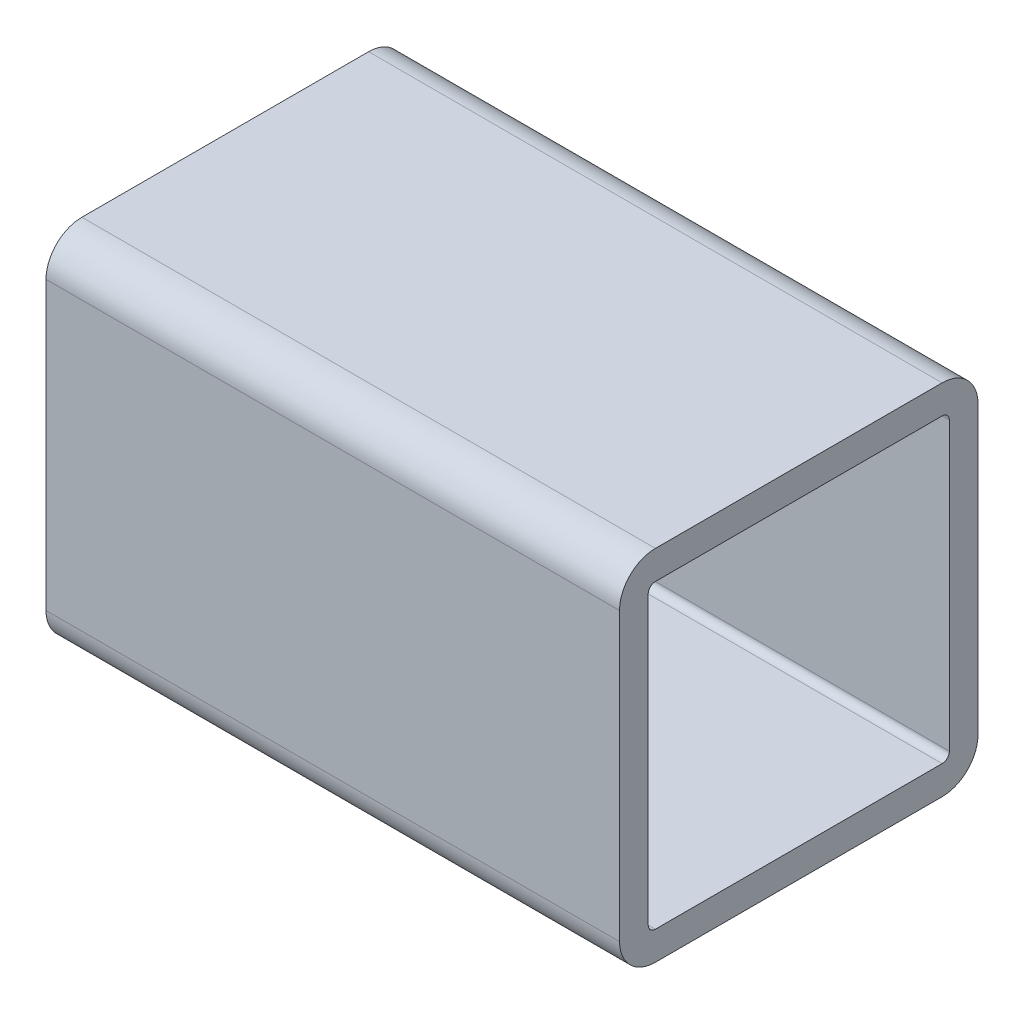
from build123d import *

# Parameters (mm, degrees)
BOSS_EXTRU_1_DEPTH = 40


with BuildPart() as part:
    # Esquisse1 → Boss.-Extru.1 (new body)
    with BuildSketch(Plane(origin=(0, 0, 0), x_dir=(0, 0, -1), z_dir=(1, 0, 0))):
        with BuildLine():
            Line((-10, 12.5), (10, 12.5))
            ThreePointArc((10, 12.5), (11.767766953, 11.767766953), (12.5, 10))
            Line((12.5, 10), (12.5, -10))
            ThreePointArc((12.5, -10), (11.767766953, -11.767766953), (10, -12.5))
            Line((10, -12.5), (-10, -12.5))
            ThreePointArc((-10, -12.5), (-11.767766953, -11.767766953), (-12.5, -10))
            Line((-12.5, -10), (-12.5, 10))
            ThreePointArc((-12.5, 10), (-11.767766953, 11.767766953), (-10, 12.5))
        make_face()
        with BuildLine():
            Line((-10, 10.5), (10, 10.5))
            ThreePointArc((10, 10.5), (10.353553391, 10.353553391), (10.5, 10))
            Line((10.5, 10), (10.5, -10))
            ThreePointArc((10.5, -10), (10.353553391, -10.353553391), (10, -10.5))
            Line((10, -10.5), (-10, -10.5))
            ThreePointArc((-10, -10.5), (-10.353553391, -10.353553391), (-10.5, -10))
            Line((-10.5, -10), (-10.5, 10))
            ThreePointArc((-10.5, 10), (-10.353553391, 10.353553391), (-10, 10.5))
        make_face(mode=Mode.SUBTRACT)
    extrude(amount=BOSS_EXTRU_1_DEPTH)


solid = part.part
